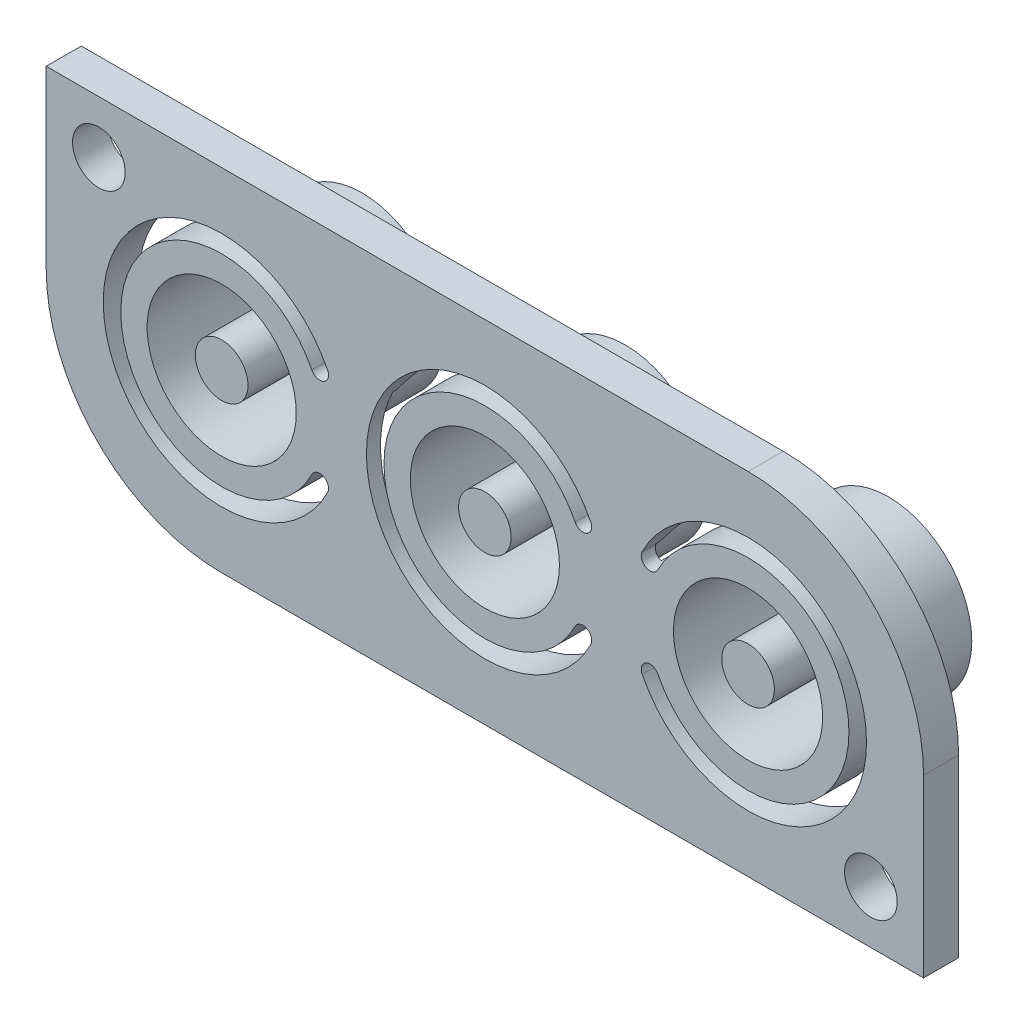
from build123d import *

# Parameters (mm, degrees)
CROQUIS1_W              = 50
CROQUIS1_H              = 20
SALIENTE_EXTRUIR1_DEPTH = 2
CROQUIS2_R              = 4.75
SALIENTE_EXTRUIR2_DEPTH = 6
CORTAR_EXTRUIR1_DEPTH   = 2
REDONDEO1_R             = 10
CROQUIS6_R              = 4.25
CORTAR_EXTRUIR3_DEPTH   = 7
CROQUIS9_R              = 1.5
SALIENTE_EXTRUIR3_DEPTH = 7
CROQUIS10_R             = 1.5
CORTAR_EXTRUIR5_DEPTH   = 2
CROQUIS11_R             = 5.75
CROQUIS11_R_2           = 6.2
CORTAR_EXTRUIR6_DEPTH   = 1.2
CHAFL_N1_SIZE           = 1
SALIENTE_EXTRUIR4_DEPTH = 1


with BuildPart() as part:
    # Croquis1 → Saliente-Extruir1 (new body)
    with BuildSketch(Plane.XY):
        with Locations((77.5, 27.5)):
            Rectangle(CROQUIS1_W, CROQUIS1_H)
    extrude(amount=SALIENTE_EXTRUIR1_DEPTH)

    # Croquis2 → Saliente-Extruir2 (add)
    with BuildSketch(Plane(origin=(0, 0, 0), x_dir=(-1, 0, 0), z_dir=(0, 0, -1))):
        with Locations(Location((-92.5, 27.5, 0), (0, 0, 180))):
            Circle(CROQUIS2_R)
        with Locations(Location((-77.5, 27.5, 0), (0, 0, 180))):
            Circle(CROQUIS2_R)
        with Locations(Location((-62.5, 27.5, 0), (0, 0, 180))):
            Circle(CROQUIS2_R)
    extrude(amount=SALIENTE_EXTRUIR2_DEPTH)

    # Croquis3 → Cortar-Extruir1 (cut)
    with BuildSketch(Plane(origin=(0, 0, 0), x_dir=(-1, 0, 0), z_dir=(0, 0, -1))):
        with BuildLine():
            ThreePointArc((-87.358619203, 30.074626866), (-86.687662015, 29.851430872), (-86.464466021, 30.52238806))
            ThreePointArc((-86.464466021, 30.52238806), (-99.25, 27.5), (-86.464466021, 24.47761194))
            ThreePointArc((-86.464466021, 24.47761194), (-86.687662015, 25.148569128), (-87.358619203, 24.925373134))
            ThreePointArc((-87.358619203, 24.925373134), (-98.25, 27.5), (-87.358619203, 30.074626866))
        make_face()
        with BuildLine():
            ThreePointArc((-82.641380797, 24.925373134), (-83.312337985, 25.148569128), (-83.535533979, 24.47761194))
            ThreePointArc((-83.535533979, 24.47761194), (-70.75, 27.5), (-83.535533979, 30.52238806))
            ThreePointArc((-83.535533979, 30.52238806), (-83.312337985, 29.851430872), (-82.641380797, 30.074626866))
            ThreePointArc((-82.641380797, 30.074626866), (-71.75, 27.5), (-82.641380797, 24.925373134))
        make_face()
        with BuildLine():
            ThreePointArc((-67.641380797, 24.925373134), (-68.312337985, 25.148569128), (-68.535533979, 24.47761194))
            ThreePointArc((-68.535533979, 24.47761194), (-55.75, 27.5), (-68.535533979, 30.52238806))
            ThreePointArc((-68.535533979, 30.52238806), (-68.312337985, 29.851430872), (-67.641380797, 30.074626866))
            ThreePointArc((-67.641380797, 30.074626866), (-56.75, 27.5), (-67.641380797, 24.925373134))
        make_face()
    extrude(amount=-CORTAR_EXTRUIR1_DEPTH, mode=Mode.SUBTRACT)

    # Redondeo1
    redondeo1_edges = [part.edges().sort_by_distance(p)[0] for p in [
        (52.5, 17.5, 1),
        (102.5, 37.5, 1),
    ]]
    fillet(redondeo1_edges, radius=REDONDEO1_R)

    # Croquis6 → Cortar-Extruir3 (cut)
    with BuildSketch(Plane.XY.offset(2)):
        with Locations((62.5, 27.5)):
            Circle(CROQUIS6_R)
        with Locations((77.5, 27.5)):
            Circle(CROQUIS6_R)
        with Locations((92.5, 27.5)):
            Circle(CROQUIS6_R)
    extrude(amount=-CORTAR_EXTRUIR3_DEPTH, mode=Mode.SUBTRACT)

    # Croquis9 → Saliente-Extruir3 (add)
    with BuildSketch(Plane.XY.offset(-5)):
        with Locations((62.5, 27.5)):
            Circle(CROQUIS9_R)
        with Locations((77.5, 27.5)):
            Circle(CROQUIS9_R)
        with Locations((92.5, 27.5)):
            Circle(CROQUIS9_R)
    extrude(amount=SALIENTE_EXTRUIR3_DEPTH)

    # Croquis10 → Cortar-Extruir5 (cut)
    with BuildSketch(Plane.XY.offset(2)):
        with Locations((99.5, 20.5)):
            Circle(CROQUIS10_R)
        with Locations((55.5, 34.5)):
            Circle(CROQUIS10_R)
    extrude(amount=-CORTAR_EXTRUIR5_DEPTH, mode=Mode.SUBTRACT)

    # Croquis11 → Cortar-Extruir6 (cut)
    with BuildSketch(Plane(origin=(0, 0, 0), x_dir=(-1, 0, 0), z_dir=(0, 0, -1))):
        with BuildLine():
            Line((-83.535533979, 24.47761194), (-86.464466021, 24.47761194))
            ThreePointArc((-86.464466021, 24.47761194), (-99.25, 27.5), (-86.464466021, 30.52238806))
            Line((-86.464466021, 30.52238806), (-83.535533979, 30.52238806))
            ThreePointArc((-83.535533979, 30.52238806), (-77.5, 34.25), (-71.464466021, 30.52238806))
            Line((-71.464466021, 30.52238806), (-68.535533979, 30.52238806))
            ThreePointArc((-68.535533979, 30.52238806), (-55.75, 27.5), (-68.535533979, 24.47761194))
            Line((-68.535533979, 24.47761194), (-71.464466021, 24.47761194))
            ThreePointArc((-71.464466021, 24.47761194), (-77.5, 20.75), (-83.535533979, 24.47761194))
        make_face()
        with Locations((-62.5, 27.5)):
            Circle(CROQUIS11_R, mode=Mode.SUBTRACT)
        with Locations((-77.5, 27.5)):
            Circle(CROQUIS11_R, mode=Mode.SUBTRACT)
        with Locations((-92.5, 27.5)):
            Circle(CROQUIS11_R_2, mode=Mode.SUBTRACT)
    extrude(amount=-CORTAR_EXTRUIR6_DEPTH, mode=Mode.SUBTRACT)

    # Chafl_n1
    chafl_n1_edges = [part.edges().sort_by_distance(p)[0] for p in [
        (85, 30.52238806, 0),
        (85, 24.47761194, 0),
        (70, 30.52238806, 0),
        (70, 24.47761194, 0),
    ]]
    chamfer(chafl_n1_edges, length=CHAFL_N1_SIZE)

    # Croquis12 → Saliente-Extruir4 (add)
    # profile 1 of 3: a face of its own
    with BuildSketch(Plane(origin=(0, 0, -6), x_dir=(-1, 0, 0), z_dir=(0, 0, -1))):
        Polygon((-65.728582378, 27.617760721), (-60.958012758, 29.751858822), (-60.314223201, 29.111036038), (-62.427553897, 24.327610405), (-63.076288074, 24.974366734), (-62.488867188, 26.212499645), (-63.868416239, 27.587104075), (-65.104571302, 26.995727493), align=None)
        Polygon((-61.24183396, 28.848971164), (-63.245394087, 27.882792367), (-62.190212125, 26.830577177), (-61.2270001, 28.834137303), align=None, mode=Mode.SUBTRACT)
    # profile 2 of 3: a face of its own
    with BuildSketch(Plane(origin=(0, 0, -6), x_dir=(-1, 0, 0), z_dir=(0, 0, -1))):
        with BuildLine():
            Line((-80.194104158, 27.217246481), (-76.74968169, 30.673536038))
            Line((-76.74968169, 30.673536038), (-75.069499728, 28.99928762))
            add(Edge.make_bspline(
                [(-75.069499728, 28.99928762), (-75.031406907, 28.959869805), (-74.957198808, 28.883080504), (-74.85725848, 28.763013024), (-74.769481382, 28.643121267), (-74.694794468, 28.522404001), (-74.634041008, 28.400607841), (-74.587719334, 28.278103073), (-74.552006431, 28.155992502), (-74.531457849, 28.033206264), (-74.524003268, 27.911119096), (-74.532026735, 27.790867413), (-74.554624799, 27.672672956), (-74.594577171, 27.557415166), (-74.646430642, 27.442885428), (-74.715918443, 27.332359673), (-74.798529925, 27.222991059), (-74.863080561, 27.155308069), (-74.896438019, 27.120331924)],
                knots=[0, 0, 0, 0, 1.226862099, 2.390033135, 3.494185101, 4.551057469, 5.564282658, 6.536022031, 7.47978362, 8.407921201, 9.317117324, 10.212034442, 11.099250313, 12.002406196, 12.936888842, 13.907703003, 14.918775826, 16, 16, 16, 16], degree=3))
            add(Edge.make_bspline(
                [(-74.896438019, 27.120331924), (-74.939852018, 27.079463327), (-75.023797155, 27.000439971), (-75.164643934, 26.906226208), (-75.310808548, 26.836820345), (-75.463612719, 26.79366792), (-75.621895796, 26.775903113), (-75.78562761, 26.783249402), (-75.955083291, 26.816604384), (-76.06613128, 26.856418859), (-76.123692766, 26.877056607)],
                knots=[0, 0, 0, 0, 1.070141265, 2.069220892, 3.031322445, 3.967217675, 4.909374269, 5.881908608, 6.902091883, 8, 8, 8, 8], degree=3))
            Line((-76.123692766, 26.877056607), (-76.133582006, 26.867167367))
            add(Edge.make_bspline(
                [(-76.133582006, 26.867167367), (-76.11369622, 26.834790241), (-76.074673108, 26.771254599), (-76.024712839, 26.673453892), (-75.986460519, 26.574768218), (-75.955922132, 26.477192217), (-75.9375611, 26.379250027), (-75.927133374, 26.282317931), (-75.927382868, 26.18523505), (-75.936778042, 26.088309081), (-75.958573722, 25.991919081), (-75.987753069, 25.89564402), (-76.028257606, 25.800481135), (-76.076554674, 25.704739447), (-76.136522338, 25.609945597), (-76.205809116, 25.515348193), (-76.284232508, 25.420382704), (-76.342784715, 25.360296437), (-76.372901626, 25.329390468)],
                knots=[0, 0, 0, 0, 1.066582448, 2.093020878, 3.077766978, 4.035126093, 4.958975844, 5.870646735, 6.768353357, 7.680024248, 8.598527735, 9.538188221, 10.500677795, 11.49817041, 12.545875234, 13.645434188, 14.788905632, 16, 16, 16, 16], degree=3))
            add(Edge.make_bspline(
                [(-76.372901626, 25.329390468), (-76.408461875, 25.29528593), (-76.47821672, 25.228386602), (-76.59264877, 25.143795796), (-76.70985266, 25.072500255), (-76.831291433, 25.016703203), (-76.956427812, 24.975928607), (-77.085482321, 24.950041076), (-77.21830116, 24.938620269), (-77.307764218, 24.943317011), (-77.352925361, 24.945687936)],
                knots=[0, 0, 0, 0, 1.085587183, 2.129483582, 3.130587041, 4.106429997, 5.069654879, 6.026273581, 7.003658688, 8, 8, 8, 8], degree=3))
            add(Edge.make_bspline(
                [(-77.352925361, 24.945687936), (-77.404574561, 24.951670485), (-77.509103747, 24.963778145), (-77.6645096, 25.006091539), (-77.820257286, 25.065947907), (-77.976931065, 25.143813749), (-78.134781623, 25.23927965), (-78.292653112, 25.353624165), (-78.451814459, 25.485549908), (-78.553479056, 25.584139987), (-78.605892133, 25.634968)],
                knots=[0, 0, 0, 0, 0.854259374, 1.728875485, 2.640236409, 3.595681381, 4.602797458, 5.671223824, 6.799401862, 8, 8, 8, 8], degree=3))
            Line((-78.605892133, 25.634968), (-80.194104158, 27.217246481))
        make_face()
        with BuildLine():
            Line((-78.020449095, 28.187380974), (-79.097387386, 27.107475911))
            Line((-79.097387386, 27.107475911), (-78.027371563, 26.041415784))
            add(Edge.make_bspline(
                [(-78.027371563, 26.041415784), (-78.003692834, 26.018242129), (-77.957888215, 25.973414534), (-77.884787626, 25.915056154), (-77.813013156, 25.864465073), (-77.741467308, 25.82221442), (-77.669705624, 25.789640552), (-77.598530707, 25.764053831), (-77.526916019, 25.7493305), (-77.455907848, 25.743586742), (-77.385043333, 25.744837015), (-77.31453407, 25.75768903), (-77.243983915, 25.77704161), (-77.174211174, 25.806482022), (-77.104812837, 25.844008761), (-77.036296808, 25.891605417), (-76.96688198, 25.946401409), (-76.923357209, 25.988910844), (-76.900987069, 26.010759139)],
                knots=[0, 0, 0, 0, 1.229602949, 2.378569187, 3.468643, 4.488993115, 5.458513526, 6.391488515, 7.291768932, 8.163982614, 9.033443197, 9.914885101, 10.817824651, 11.745322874, 12.720314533, 13.742278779, 14.839613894, 16, 16, 16, 16], degree=3))
            add(Edge.make_bspline(
                [(-76.900987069, 26.010759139), (-76.879808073, 26.032478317), (-76.838632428, 26.074704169), (-76.785474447, 26.142242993), (-76.740091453, 26.209676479), (-76.704692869, 26.278300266), (-76.676411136, 26.34658383), (-76.657276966, 26.415635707), (-76.647378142, 26.485090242), (-76.646244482, 26.554907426), (-76.654729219, 26.624848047), (-76.670341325, 26.695295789), (-76.695376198, 26.765957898), (-76.729862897, 26.836275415), (-76.770999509, 26.908178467), (-76.823535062, 26.978797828), (-76.882378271, 27.051597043), (-76.927290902, 27.097610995), (-76.950433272, 27.121320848)],
                knots=[0, 0, 0, 0, 1.141334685, 2.218952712, 3.230898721, 4.196744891, 5.120868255, 6.009044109, 6.886578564, 7.755381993, 8.629751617, 9.532972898, 10.467124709, 11.444069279, 12.478518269, 13.580723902, 14.753406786, 16, 16, 16, 16], degree=3))
            Line((-76.950433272, 27.121320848), (-78.020449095, 28.187380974))
        make_face(mode=Mode.SUBTRACT)
        with BuildLine():
            Line((-76.635955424, 29.576819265), (-77.586311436, 28.623496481))
            Line((-77.586311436, 28.623496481), (-76.59837631, 27.63951705))
            add(Edge.make_bspline(
                [(-76.59837631, 27.63951705), (-76.561613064, 27.605410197), (-76.490405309, 27.539347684), (-76.367723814, 27.467152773), (-76.240731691, 27.417591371), (-76.13029606, 27.398873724), (-76.041778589, 27.399132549), (-75.976304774, 27.405620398), (-75.91198445, 27.421015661), (-75.84925073, 27.443483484), (-75.787782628, 27.474042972), (-75.727572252, 27.511421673), (-75.668780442, 27.557416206), (-75.632216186, 27.592692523), (-75.613407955, 27.610838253)],
                knots=[0, 0, 0, 0, 1.619208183, 3.136289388, 4.575056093, 6.013545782, 6.728483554, 7.436700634, 8.138132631, 8.863819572, 9.589192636, 10.356074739, 11.154383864, 12, 12, 12, 12], degree=3))
            add(Edge.make_bspline(
                [(-75.613407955, 27.610838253), (-75.577668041, 27.649570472), (-75.510273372, 27.722607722), (-75.435968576, 27.844923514), (-75.390976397, 27.968344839), (-75.379750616, 28.094693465), (-75.400796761, 28.221450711), (-75.45345368, 28.347993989), (-75.536972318, 28.474431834), (-75.609468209, 28.551732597), (-75.648020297, 28.592839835)],
                knots=[0, 0, 0, 0, 1.121384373, 2.114591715, 3.030378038, 3.898310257, 4.788023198, 5.743382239, 6.799968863, 8, 8, 8, 8], degree=3))
            Line((-75.648020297, 28.592839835), (-76.635955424, 29.576819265))
        make_face(mode=Mode.SUBTRACT)
    # profile 3 of 3: a face of its own
    with BuildSketch(Plane(origin=(0, 0, -6), x_dir=(-1, 0, 0), z_dir=(0, 0, -1))):
        with BuildLine():
            Line((-90.685693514, 26.645648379), (-91.290915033, 27.24889205))
            add(Edge.make_bspline(
                [(-91.290915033, 27.24889205), (-91.270582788, 27.284201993), (-91.230813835, 27.353266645), (-91.181685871, 27.459729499), (-91.140646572, 27.564217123), (-91.110026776, 27.667534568), (-91.087815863, 27.769301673), (-91.074768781, 27.869874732), (-91.071616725, 27.969263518), (-91.078817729, 28.066936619), (-91.094778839, 28.163222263), (-91.119166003, 28.258507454), (-91.154621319, 28.351822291), (-91.197800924, 28.444226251), (-91.252075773, 28.534299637), (-91.31455063, 28.623745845), (-91.38662045, 28.71171996), (-91.440488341, 28.767268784), (-91.467932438, 28.795569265)],
                knots=[0, 0, 0, 0, 1.149058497, 2.247506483, 3.304540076, 4.313851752, 5.284321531, 6.240649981, 7.171121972, 8.084896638, 8.9992391, 9.921869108, 10.854755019, 11.811626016, 12.795770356, 13.817517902, 14.888089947, 16, 16, 16, 16], degree=3))
            add(Edge.make_bspline(
                [(-91.467932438, 28.795569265), (-91.511194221, 28.836529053), (-91.595486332, 28.916335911), (-91.734705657, 29.015736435), (-91.878644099, 29.096140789), (-92.029219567, 29.154622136), (-92.18502764, 29.193708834), (-92.346187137, 29.212444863), (-92.513071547, 29.210687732), (-92.624449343, 29.193821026), (-92.681342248, 29.185205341)],
                knots=[0, 0, 0, 0, 1.074026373, 2.092654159, 3.077797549, 4.042193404, 4.99875997, 5.969063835, 6.962577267, 8, 8, 8, 8], degree=3))
            add(Edge.make_bspline(
                [(-92.681342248, 29.185205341), (-92.731688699, 29.174605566), (-92.832970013, 29.153282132), (-92.981745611, 29.103808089), (-93.128324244, 29.041127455), (-93.273375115, 28.965801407), (-93.416119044, 28.875935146), (-93.557556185, 28.773298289), (-93.69629142, 28.655835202), (-93.785119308, 28.570269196), (-93.830471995, 28.526581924)],
                knots=[0, 0, 0, 0, 0.917545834, 1.84581523, 2.792028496, 3.760275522, 4.759201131, 5.799348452, 6.876417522, 8, 8, 8, 8], degree=3))
            add(Edge.make_bspline(
                [(-93.830471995, 28.526581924), (-93.874299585, 28.481344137), (-93.96016923, 28.392711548), (-94.075681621, 28.252325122), (-94.179436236, 28.111506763), (-94.267221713, 27.967322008), (-94.343326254, 27.822281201), (-94.405756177, 27.67530406), (-94.453969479, 27.525936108), (-94.475443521, 27.42480602), (-94.48612864, 27.374485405)],
                knots=[0, 0, 0, 0, 1.122705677, 2.199672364, 3.239007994, 4.239056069, 5.206547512, 6.157433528, 7.083170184, 8, 8, 8, 8], degree=3))
            add(Edge.make_bspline(
                [(-94.48612864, 27.374485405), (-94.494452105, 27.317580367), (-94.510751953, 27.206143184), (-94.511020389, 27.039354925), (-94.493041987, 26.878006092), (-94.452385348, 26.722810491), (-94.394135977, 26.572232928), (-94.312510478, 26.429124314), (-94.213380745, 26.289576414), (-94.13352285, 26.205312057), (-94.092536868, 26.162064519)],
                knots=[0, 0, 0, 0, 1.036945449, 2.030651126, 3.001194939, 3.959458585, 4.918553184, 5.906828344, 6.925708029, 8, 8, 8, 8], degree=3))
            add(Edge.make_bspline(
                [(-94.092536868, 26.162064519), (-94.060126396, 26.131426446), (-93.996745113, 26.071511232), (-93.89399339, 25.994057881), (-93.788074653, 25.928810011), (-93.677356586, 25.878847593), (-93.564150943, 25.838959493), (-93.446369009, 25.815199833), (-93.325460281, 25.80096894), (-93.243744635, 25.8036898), (-93.202505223, 25.805062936)],
                knots=[0, 0, 0, 0, 1.08105201, 2.114084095, 3.115089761, 4.091787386, 5.055139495, 6.019552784, 7.000528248, 8, 8, 8, 8], degree=3))
            add(Edge.make_bspline(
                [(-93.202505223, 25.805062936), (-93.164180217, 25.808326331), (-93.087699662, 25.814838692), (-92.9737791, 25.837160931), (-92.860887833, 25.870306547), (-92.748051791, 25.912366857), (-92.63656614, 25.966674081), (-92.526079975, 26.031124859), (-92.415878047, 26.105249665), (-92.345398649, 26.16124076), (-92.309506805, 26.189754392)],
                knots=[0, 0, 0, 0, 0.932902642, 1.861680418, 2.81107182, 3.785740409, 4.780393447, 5.816299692, 6.887944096, 8, 8, 8, 8], degree=3))
            Line((-92.309506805, 26.189754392), (-91.718130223, 25.600355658))
            add(Edge.make_bspline(
                [(-91.718130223, 25.600355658), (-91.772972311, 25.553412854), (-91.880646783, 25.461247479), (-92.054183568, 25.344504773), (-92.22911169, 25.24298529), (-92.409726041, 25.162721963), (-92.593976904, 25.099995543), (-92.782428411, 25.055960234), (-92.975033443, 25.032825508), (-93.169744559, 25.026206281), (-93.364093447, 25.040690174), (-93.555107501, 25.071763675), (-93.740897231, 25.123314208), (-93.920757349, 25.195881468), (-94.096380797, 25.284651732), (-94.266294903, 25.393279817), (-94.430350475, 25.521699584), (-94.532727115, 25.618927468), (-94.585021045, 25.668591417)],
                knots=[0, 0, 0, 0, 1.085208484, 2.130649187, 3.141315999, 4.124749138, 5.098670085, 6.065888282, 7.030419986, 8.01282719, 8.992288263, 9.957622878, 10.920214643, 11.886275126, 12.871045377, 13.876735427, 14.915437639, 16, 16, 16, 16], degree=3))
            add(Edge.make_bspline(
                [(-94.585021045, 25.668591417), (-94.645113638, 25.731315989), (-94.762768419, 25.854123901), (-94.912021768, 26.05570633), (-95.037233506, 26.263276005), (-95.135853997, 26.479255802), (-95.208407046, 26.702928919), (-95.255209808, 26.934084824), (-95.275725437, 27.173138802), (-95.268220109, 27.33426432), (-95.264411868, 27.416020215)],
                knots=[0, 0, 0, 0, 1.074807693, 2.104356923, 3.09850438, 4.07219157, 5.037835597, 6.004161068, 6.98730134, 8, 8, 8, 8], degree=3))
            add(Edge.make_bspline(
                [(-95.264411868, 27.416020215), (-95.256780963, 27.494382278), (-95.241592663, 27.650351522), (-95.190416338, 27.879575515), (-95.120483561, 28.103744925), (-95.02699161, 28.32153589), (-94.911291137, 28.533460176), (-94.773679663, 28.739101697), (-94.617134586, 28.941497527), (-94.496907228, 29.066288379), (-94.435693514, 29.129825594)],
                knots=[0, 0, 0, 0, 0.970285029, 1.931223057, 2.890482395, 3.863175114, 4.849277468, 5.864153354, 6.912534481, 8, 8, 8, 8], degree=3))
            add(Edge.make_bspline(
                [(-94.435693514, 29.129825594), (-94.371630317, 29.19112322), (-94.245873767, 29.311450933), (-94.04558347, 29.472226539), (-93.839068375, 29.610492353), (-93.626662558, 29.72679747), (-93.408680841, 29.821564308), (-93.184484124, 29.892371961), (-92.955352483, 29.944875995), (-92.799278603, 29.959899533), (-92.72089921, 29.967444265)],
                knots=[0, 0, 0, 0, 1.090266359, 2.140201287, 3.154590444, 4.143537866, 5.115210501, 6.073113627, 7.032328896, 8, 8, 8, 8], degree=3))
            add(Edge.make_bspline(
                [(-92.72089921, 29.967444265), (-92.639473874, 29.971252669), (-92.479008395, 29.978757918), (-92.240599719, 29.958215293), (-92.010267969, 29.911307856), (-91.786618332, 29.83998431), (-91.570990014, 29.740899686), (-91.362661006, 29.616420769), (-91.161307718, 29.466743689), (-91.038231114, 29.34972429), (-90.975448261, 29.290031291)],
                knots=[0, 0, 0, 0, 1.010200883, 1.990809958, 2.958652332, 3.920664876, 4.895880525, 5.895099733, 6.926265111, 8, 8, 8, 8], degree=3))
            add(Edge.make_bspline(
                [(-90.975448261, 29.290031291), (-90.927523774, 29.240636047), (-90.833728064, 29.143961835), (-90.708548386, 28.989143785), (-90.598600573, 28.831257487), (-90.504275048, 28.66959064), (-90.425011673, 28.504480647), (-90.363502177, 28.334958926), (-90.314073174, 28.162390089), (-90.296132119, 28.044576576), (-90.287157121, 27.985640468)],
                knots=[0, 0, 0, 0, 1.099039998, 2.150993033, 3.176513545, 4.170070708, 5.138222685, 6.097930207, 7.048491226, 8, 8, 8, 8], degree=3))
            add(Edge.make_bspline(
                [(-90.287157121, 27.985640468), (-90.281302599, 27.924721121), (-90.269766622, 27.804683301), (-90.274077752, 27.625250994), (-90.297002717, 27.450311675), (-90.33762057, 27.279574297), (-90.396405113, 27.113060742), (-90.474068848, 26.951370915), (-90.570442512, 26.79410071), (-90.646817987, 26.695723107), (-90.685693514, 26.645648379)],
                knots=[0, 0, 0, 0, 1.019875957, 2.009602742, 2.985323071, 3.957319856, 4.930947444, 5.924285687, 6.943450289, 8, 8, 8, 8], degree=3))
        make_face()
    extrude(amount=SALIENTE_EXTRUIR4_DEPTH)


solid = part.part
